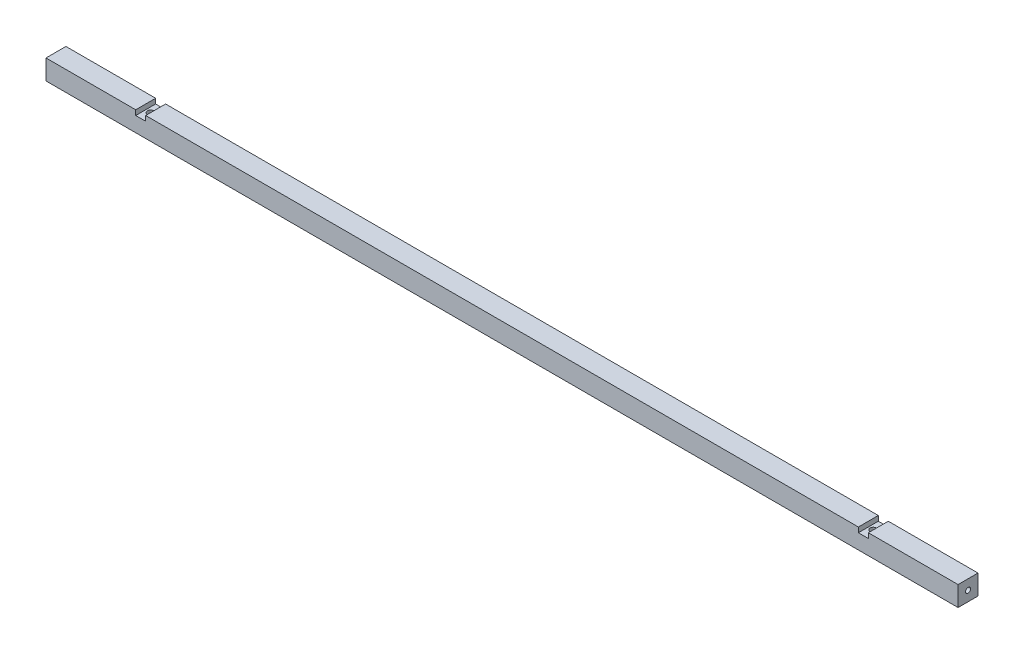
ISO-10303-21;
HEADER;
FILE_DESCRIPTION(('STEP AP214'),'2;1');
FILE_NAME('part.step','',(''),(''),'','','');
FILE_SCHEMA(('AUTOMOTIVE_DESIGN { 1 0 10303 214 1 1 1 1 }'));
ENDSEC;
DATA;
#1=APPLICATION_CONTEXT('core data for automotive mechanical design processes');
#2=APPLICATION_PROTOCOL_DEFINITION('international standard','automotive_design',2000,#1);
#3=PRODUCT_CONTEXT('',#1,'mechanical');
#4=PRODUCT('Part','Part','',(#3));
#5=PRODUCT_RELATED_PRODUCT_CATEGORY('part','',(#4));
#6=PRODUCT_DEFINITION_FORMATION('','',#4);
#7=PRODUCT_DEFINITION_CONTEXT('part definition',#1,'design');
#8=PRODUCT_DEFINITION('design','',#6,#7);
#9=PRODUCT_DEFINITION_SHAPE('','',#8);
#10=(LENGTH_UNIT() NAMED_UNIT(*) SI_UNIT(.MILLI.,.METRE.));
#11=(NAMED_UNIT(*) PLANE_ANGLE_UNIT() SI_UNIT($,.RADIAN.));
#12=(NAMED_UNIT(*) SI_UNIT($,.STERADIAN.) SOLID_ANGLE_UNIT());
#13=UNCERTAINTY_MEASURE_WITH_UNIT(LENGTH_MEASURE(1.E-05),#10,'distance_accuracy_value','');
#14=(GEOMETRIC_REPRESENTATION_CONTEXT(3) GLOBAL_UNCERTAINTY_ASSIGNED_CONTEXT((#13)) GLOBAL_UNIT_ASSIGNED_CONTEXT((#10,
#11,#12)) REPRESENTATION_CONTEXT('',''));
#15=CARTESIAN_POINT('',(0.,0.,0.));
#16=DIRECTION('',(0.,0.,1.));
#17=DIRECTION('',(1.,0.,0.));
#18=AXIS2_PLACEMENT_3D('',#15,#16,#17);
#19=CARTESIAN_POINT('',(0.,20.,10.));
#20=DIRECTION('',(1.,0.,0.));
#21=DIRECTION('',(0.,1.,0.));
#22=AXIS2_PLACEMENT_3D('',#19,#20,#21);
#23=PLANE('',#22);
#24=CARTESIAN_POINT('',(0.,10.,0.));
#25=DIRECTION('',(-1.,0.,0.));
#26=DIRECTION('',(0.,0.,1.));
#27=AXIS2_PLACEMENT_3D('',#24,#25,#26);
#28=CIRCLE('',#27,2.49999999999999);
#29=CARTESIAN_POINT('',(0.,10.,2.49999999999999));
#30=VERTEX_POINT('',#29);
#31=EDGE_CURVE('E300',#30,#30,#28,.T.);
#32=ORIENTED_EDGE('',*,*,#31,.F.);
#33=EDGE_LOOP('',(#32));
#34=FACE_BOUND('',#33,.T.);
#35=DIRECTION('',(0.,-1.,0.));
#36=VECTOR('',#35,1.);
#37=CARTESIAN_POINT('',(0.,20.,-10.));
#38=LINE('',#37,#36);
#39=CARTESIAN_POINT('',(0.,20.,-10.));
#40=VERTEX_POINT('',#39);
#41=CARTESIAN_POINT('',(0.,0.,-10.));
#42=VERTEX_POINT('',#41);
#43=EDGE_CURVE('E167',#40,#42,#38,.T.);
#44=ORIENTED_EDGE('',*,*,#43,.T.);
#45=DIRECTION('',(0.,0.,-1.));
#46=VECTOR('',#45,1.);
#47=CARTESIAN_POINT('',(0.,0.,10.));
#48=LINE('',#47,#46);
#49=CARTESIAN_POINT('',(0.,0.,10.));
#50=VERTEX_POINT('',#49);
#51=EDGE_CURVE('E11',#50,#42,#48,.T.);
#52=ORIENTED_EDGE('',*,*,#51,.F.);
#53=DIRECTION('',(0.,-1.,0.));
#54=VECTOR('',#53,1.);
#55=CARTESIAN_POINT('',(0.,20.,10.));
#56=LINE('',#55,#54);
#57=CARTESIAN_POINT('',(0.,20.,10.));
#58=VERTEX_POINT('',#57);
#59=EDGE_CURVE('E202',#58,#50,#56,.T.);
#60=ORIENTED_EDGE('',*,*,#59,.F.);
#61=DIRECTION('',(0.,0.,-1.));
#62=VECTOR('',#61,1.);
#63=CARTESIAN_POINT('',(0.,20.,10.));
#64=LINE('',#63,#62);
#65=EDGE_CURVE('E163',#58,#40,#64,.T.);
#66=ORIENTED_EDGE('',*,*,#65,.T.);
#67=EDGE_LOOP('',(#44,#52,#60,#66));
#68=FACE_BOUND('',#67,.T.);
#69=ADVANCED_FACE('F38',(#34,#68),#23,.F.);
#70=CARTESIAN_POINT('',(0.,0.,10.));
#71=DIRECTION('',(0.,1.,0.));
#72=DIRECTION('',(0.,0.,1.));
#73=AXIS2_PLACEMENT_3D('',#70,#71,#72);
#74=PLANE('',#73);
#75=CARTESIAN_POINT('',(95.,0.,0.));
#76=DIRECTION('',(0.,1.,0.));
#77=DIRECTION('',(0.,0.,1.));
#78=AXIS2_PLACEMENT_3D('',#75,#76,#77);
#79=CIRCLE('',#78,3.25000000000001);
#80=CARTESIAN_POINT('',(95.,0.,3.25000000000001));
#81=VERTEX_POINT('',#80);
#82=EDGE_CURVE('E276',#81,#81,#79,.F.);
#83=ORIENTED_EDGE('',*,*,#82,.F.);
#84=EDGE_LOOP('',(#83));
#85=FACE_BOUND('',#84,.T.);
#86=CARTESIAN_POINT('',(820.,0.,0.));
#87=DIRECTION('',(0.,1.,0.));
#88=DIRECTION('',(0.,0.,1.));
#89=AXIS2_PLACEMENT_3D('',#86,#87,#88);
#90=CIRCLE('',#89,3.24999999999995);
#91=CARTESIAN_POINT('',(820.,0.,3.24999999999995));
#92=VERTEX_POINT('',#91);
#93=EDGE_CURVE('E172',#92,#92,#90,.F.);
#94=ORIENTED_EDGE('',*,*,#93,.F.);
#95=EDGE_LOOP('',(#94));
#96=FACE_BOUND('',#95,.T.);
#97=DIRECTION('',(1.,0.,0.));
#98=VECTOR('',#97,1.);
#99=CARTESIAN_POINT('',(0.,0.,-10.));
#100=LINE('',#99,#98);
#101=CARTESIAN_POINT('',(915.,0.,-10.));
#102=VERTEX_POINT('',#101);
#103=EDGE_CURVE('E171',#42,#102,#100,.T.);
#104=ORIENTED_EDGE('',*,*,#103,.T.);
#105=DIRECTION('',(0.,0.,-1.));
#106=VECTOR('',#105,1.);
#107=CARTESIAN_POINT('',(915.,0.,10.));
#108=LINE('',#107,#106);
#109=CARTESIAN_POINT('',(915.,0.,10.));
#110=VERTEX_POINT('',#109);
#111=EDGE_CURVE('E47',#110,#102,#108,.T.);
#112=ORIENTED_EDGE('',*,*,#111,.F.);
#113=DIRECTION('',(1.,0.,0.));
#114=VECTOR('',#113,1.);
#115=CARTESIAN_POINT('',(0.,0.,10.));
#116=LINE('',#115,#114);
#117=EDGE_CURVE('E111',#50,#110,#116,.T.);
#118=ORIENTED_EDGE('',*,*,#117,.F.);
#119=ORIENTED_EDGE('',*,*,#51,.T.);
#120=EDGE_LOOP('',(#104,#112,#118,#119));
#121=FACE_BOUND('',#120,.T.);
#122=ADVANCED_FACE('F320',(#85,#96,#121),#74,.F.);
#123=CARTESIAN_POINT('',(915.,0.,10.));
#124=DIRECTION('',(-1.,0.,0.));
#125=DIRECTION('',(0.,0.,1.));
#126=AXIS2_PLACEMENT_3D('',#123,#124,#125);
#127=PLANE('',#126);
#128=CARTESIAN_POINT('',(915.,10.,0.));
#129=DIRECTION('',(1.,0.,0.));
#130=DIRECTION('',(0.,0.,-1.));
#131=AXIS2_PLACEMENT_3D('',#128,#129,#130);
#132=CIRCLE('',#131,2.49999999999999);
#133=CARTESIAN_POINT('',(915.,10.,-2.49999999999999));
#134=VERTEX_POINT('',#133);
#135=EDGE_CURVE('E293',#134,#134,#132,.T.);
#136=ORIENTED_EDGE('',*,*,#135,.F.);
#137=EDGE_LOOP('',(#136));
#138=FACE_BOUND('',#137,.T.);
#139=DIRECTION('',(0.,1.,0.));
#140=VECTOR('',#139,1.);
#141=CARTESIAN_POINT('',(915.,0.,-10.));
#142=LINE('',#141,#140);
#143=CARTESIAN_POINT('',(915.,20.,-10.));
#144=VERTEX_POINT('',#143);
#145=EDGE_CURVE('E175',#102,#144,#142,.T.);
#146=ORIENTED_EDGE('',*,*,#145,.T.);
#147=DIRECTION('',(0.,0.,-1.));
#148=VECTOR('',#147,1.);
#149=CARTESIAN_POINT('',(915.,20.,10.));
#150=LINE('',#149,#148);
#151=CARTESIAN_POINT('',(915.,20.,10.));
#152=VERTEX_POINT('',#151);
#153=EDGE_CURVE('E229',#152,#144,#150,.T.);
#154=ORIENTED_EDGE('',*,*,#153,.F.);
#155=DIRECTION('',(0.,1.,0.));
#156=VECTOR('',#155,1.);
#157=CARTESIAN_POINT('',(915.,0.,10.));
#158=LINE('',#157,#156);
#159=EDGE_CURVE('E240',#110,#152,#158,.T.);
#160=ORIENTED_EDGE('',*,*,#159,.F.);
#161=ORIENTED_EDGE('',*,*,#111,.T.);
#162=EDGE_LOOP('',(#146,#154,#160,#161));
#163=FACE_BOUND('',#162,.T.);
#164=ADVANCED_FACE('F238',(#138,#163),#127,.F.);
#165=CARTESIAN_POINT('',(915.,20.,10.));
#166=DIRECTION('',(0.,-1.,0.));
#167=DIRECTION('',(1.,0.,0.));
#168=AXIS2_PLACEMENT_3D('',#165,#166,#167);
#169=PLANE('',#168);
#170=DIRECTION('',(-1.,0.,0.));
#171=VECTOR('',#170,1.);
#172=CARTESIAN_POINT('',(915.,20.,-10.));
#173=LINE('',#172,#171);
#174=CARTESIAN_POINT('',(825.,20.,-10.));
#175=VERTEX_POINT('',#174);
#176=EDGE_CURVE('E178',#144,#175,#173,.T.);
#177=ORIENTED_EDGE('',*,*,#176,.T.);
#178=DIRECTION('',(0.,0.,-1.));
#179=VECTOR('',#178,1.);
#180=CARTESIAN_POINT('',(825.,20.,10.));
#181=LINE('',#180,#179);
#182=CARTESIAN_POINT('',(825.,20.,10.));
#183=VERTEX_POINT('',#182);
#184=EDGE_CURVE('E225',#183,#175,#181,.T.);
#185=ORIENTED_EDGE('',*,*,#184,.F.);
#186=DIRECTION('',(-1.,0.,0.));
#187=VECTOR('',#186,1.);
#188=CARTESIAN_POINT('',(915.,20.,10.));
#189=LINE('',#188,#187);
#190=EDGE_CURVE('E259',#152,#183,#189,.T.);
#191=ORIENTED_EDGE('',*,*,#190,.F.);
#192=ORIENTED_EDGE('',*,*,#153,.T.);
#193=EDGE_LOOP('',(#177,#185,#191,#192));
#194=FACE_BOUND('',#193,.T.);
#195=ADVANCED_FACE('F249',(#194),#169,.F.);
#196=CARTESIAN_POINT('',(825.,20.,10.));
#197=DIRECTION('',(1.,0.,0.));
#198=DIRECTION('',(0.,0.,-1.));
#199=AXIS2_PLACEMENT_3D('',#196,#197,#198);
#200=PLANE('',#199);
#201=DIRECTION('',(0.,-1.,0.));
#202=VECTOR('',#201,1.);
#203=CARTESIAN_POINT('',(825.,20.,-10.));
#204=LINE('',#203,#202);
#205=CARTESIAN_POINT('',(825.,15.,-10.));
#206=VERTEX_POINT('',#205);
#207=EDGE_CURVE('E181',#175,#206,#204,.T.);
#208=ORIENTED_EDGE('',*,*,#207,.T.);
#209=DIRECTION('',(0.,0.,-1.));
#210=VECTOR('',#209,1.);
#211=CARTESIAN_POINT('',(825.,15.,10.));
#212=LINE('',#211,#210);
#213=CARTESIAN_POINT('',(825.,15.,10.));
#214=VERTEX_POINT('',#213);
#215=EDGE_CURVE('E221',#214,#206,#212,.T.);
#216=ORIENTED_EDGE('',*,*,#215,.F.);
#217=DIRECTION('',(0.,-1.,0.));
#218=VECTOR('',#217,1.);
#219=CARTESIAN_POINT('',(825.,20.,10.));
#220=LINE('',#219,#218);
#221=EDGE_CURVE('E255',#183,#214,#220,.T.);
#222=ORIENTED_EDGE('',*,*,#221,.F.);
#223=ORIENTED_EDGE('',*,*,#184,.T.);
#224=EDGE_LOOP('',(#208,#216,#222,#223));
#225=FACE_BOUND('',#224,.T.);
#226=ADVANCED_FACE('F253',(#225),#200,.F.);
#227=CARTESIAN_POINT('',(825.,15.,10.));
#228=DIRECTION('',(0.,-1.,0.));
#229=DIRECTION('',(1.,0.,0.));
#230=AXIS2_PLACEMENT_3D('',#227,#228,#229);
#231=PLANE('',#230);
#232=CARTESIAN_POINT('',(820.,14.9999999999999,0.));
#233=DIRECTION('',(0.,1.,0.));
#234=DIRECTION('',(0.,0.,1.));
#235=AXIS2_PLACEMENT_3D('',#232,#233,#234);
#236=CIRCLE('',#235,3.24999999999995);
#237=CARTESIAN_POINT('',(820.,14.9999999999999,3.24999999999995));
#238=VERTEX_POINT('',#237);
#239=EDGE_CURVE('E273',#238,#238,#236,.T.);
#240=ORIENTED_EDGE('',*,*,#239,.F.);
#241=EDGE_LOOP('',(#240));
#242=FACE_BOUND('',#241,.T.);
#243=DIRECTION('',(-1.,0.,0.));
#244=VECTOR('',#243,1.);
#245=CARTESIAN_POINT('',(825.,15.,-10.));
#246=LINE('',#245,#244);
#247=CARTESIAN_POINT('',(815.,15.,-10.));
#248=VERTEX_POINT('',#247);
#249=EDGE_CURVE('E184',#206,#248,#246,.T.);
#250=ORIENTED_EDGE('',*,*,#249,.T.);
#251=DIRECTION('',(0.,0.,-1.));
#252=VECTOR('',#251,1.);
#253=CARTESIAN_POINT('',(815.,15.,10.));
#254=LINE('',#253,#252);
#255=CARTESIAN_POINT('',(815.,15.,10.));
#256=VERTEX_POINT('',#255);
#257=EDGE_CURVE('E217',#256,#248,#254,.T.);
#258=ORIENTED_EDGE('',*,*,#257,.F.);
#259=DIRECTION('',(-1.,0.,0.));
#260=VECTOR('',#259,1.);
#261=CARTESIAN_POINT('',(825.,15.,10.));
#262=LINE('',#261,#260);
#263=EDGE_CURVE('E258',#214,#256,#262,.T.);
#264=ORIENTED_EDGE('',*,*,#263,.F.);
#265=ORIENTED_EDGE('',*,*,#215,.T.);
#266=EDGE_LOOP('',(#250,#258,#264,#265));
#267=FACE_BOUND('',#266,.T.);
#268=ADVANCED_FACE('F338',(#242,#267),#231,.F.);
#269=CARTESIAN_POINT('',(815.,15.,10.));
#270=DIRECTION('',(-1.,0.,0.));
#271=DIRECTION('',(0.,0.,1.));
#272=AXIS2_PLACEMENT_3D('',#269,#270,#271);
#273=PLANE('',#272);
#274=DIRECTION('',(0.,1.,0.));
#275=VECTOR('',#274,1.);
#276=CARTESIAN_POINT('',(815.,15.,-10.));
#277=LINE('',#276,#275);
#278=CARTESIAN_POINT('',(815.,20.,-10.));
#279=VERTEX_POINT('',#278);
#280=EDGE_CURVE('E187',#248,#279,#277,.T.);
#281=ORIENTED_EDGE('',*,*,#280,.T.);
#282=DIRECTION('',(0.,0.,-1.));
#283=VECTOR('',#282,1.);
#284=CARTESIAN_POINT('',(815.,20.,10.));
#285=LINE('',#284,#283);
#286=CARTESIAN_POINT('',(815.,20.,10.));
#287=VERTEX_POINT('',#286);
#288=EDGE_CURVE('E213',#287,#279,#285,.T.);
#289=ORIENTED_EDGE('',*,*,#288,.F.);
#290=DIRECTION('',(0.,1.,0.));
#291=VECTOR('',#290,1.);
#292=CARTESIAN_POINT('',(815.,15.,10.));
#293=LINE('',#292,#291);
#294=EDGE_CURVE('E262',#256,#287,#293,.T.);
#295=ORIENTED_EDGE('',*,*,#294,.F.);
#296=ORIENTED_EDGE('',*,*,#257,.T.);
#297=EDGE_LOOP('',(#281,#289,#295,#296));
#298=FACE_BOUND('',#297,.T.);
#299=ADVANCED_FACE('F335',(#298),#273,.F.);
#300=CARTESIAN_POINT('',(815.,20.,10.));
#301=DIRECTION('',(0.,-1.,0.));
#302=DIRECTION('',(1.,0.,0.));
#303=AXIS2_PLACEMENT_3D('',#300,#301,#302);
#304=PLANE('',#303);
#305=DIRECTION('',(-1.,0.,0.));
#306=VECTOR('',#305,1.);
#307=CARTESIAN_POINT('',(815.,20.,-10.));
#308=LINE('',#307,#306);
#309=CARTESIAN_POINT('',(99.9999999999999,19.9999999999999,-10.));
#310=VERTEX_POINT('',#309);
#311=EDGE_CURVE('E190',#279,#310,#308,.T.);
#312=ORIENTED_EDGE('',*,*,#311,.T.);
#313=DIRECTION('',(0.,0.,-1.));
#314=VECTOR('',#313,1.);
#315=CARTESIAN_POINT('',(99.9999999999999,19.9999999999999,10.));
#316=LINE('',#315,#314);
#317=CARTESIAN_POINT('',(99.9999999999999,19.9999999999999,10.));
#318=VERTEX_POINT('',#317);
#319=EDGE_CURVE('E209',#318,#310,#316,.T.);
#320=ORIENTED_EDGE('',*,*,#319,.F.);
#321=DIRECTION('',(-1.,0.,0.));
#322=VECTOR('',#321,1.);
#323=CARTESIAN_POINT('',(815.,20.,10.));
#324=LINE('',#323,#322);
#325=EDGE_CURVE('E270',#287,#318,#324,.T.);
#326=ORIENTED_EDGE('',*,*,#325,.F.);
#327=ORIENTED_EDGE('',*,*,#288,.T.);
#328=EDGE_LOOP('',(#312,#320,#326,#327));
#329=FACE_BOUND('',#328,.T.);
#330=ADVANCED_FACE('F331',(#329),#304,.F.);
#331=CARTESIAN_POINT('',(99.9999999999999,19.9999999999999,10.));
#332=DIRECTION('',(1.,0.,0.));
#333=DIRECTION('',(0.,0.,-1.));
#334=AXIS2_PLACEMENT_3D('',#331,#332,#333);
#335=PLANE('',#334);
#336=DIRECTION('',(0.,-1.,0.));
#337=VECTOR('',#336,1.);
#338=CARTESIAN_POINT('',(99.9999999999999,19.9999999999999,-10.));
#339=LINE('',#338,#337);
#340=CARTESIAN_POINT('',(99.9999999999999,14.9999999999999,-10.));
#341=VERTEX_POINT('',#340);
#342=EDGE_CURVE('E193',#310,#341,#339,.T.);
#343=ORIENTED_EDGE('',*,*,#342,.T.);
#344=DIRECTION('',(0.,0.,-1.));
#345=VECTOR('',#344,1.);
#346=CARTESIAN_POINT('',(99.9999999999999,14.9999999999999,10.));
#347=LINE('',#346,#345);
#348=CARTESIAN_POINT('',(99.9999999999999,14.9999999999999,10.));
#349=VERTEX_POINT('',#348);
#350=EDGE_CURVE('E155',#349,#341,#347,.T.);
#351=ORIENTED_EDGE('',*,*,#350,.F.);
#352=DIRECTION('',(0.,-1.,0.));
#353=VECTOR('',#352,1.);
#354=CARTESIAN_POINT('',(99.9999999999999,19.9999999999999,10.));
#355=LINE('',#354,#353);
#356=EDGE_CURVE('E144',#318,#349,#355,.T.);
#357=ORIENTED_EDGE('',*,*,#356,.F.);
#358=ORIENTED_EDGE('',*,*,#319,.T.);
#359=EDGE_LOOP('',(#343,#351,#357,#358));
#360=FACE_BOUND('',#359,.T.);
#361=ADVANCED_FACE('F327',(#360),#335,.F.);
#362=CARTESIAN_POINT('',(99.9999999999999,14.9999999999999,10.));
#363=DIRECTION('',(0.,-1.,0.));
#364=DIRECTION('',(1.,0.,0.));
#365=AXIS2_PLACEMENT_3D('',#362,#363,#364);
#366=PLANE('',#365);
#367=CARTESIAN_POINT('',(95.,14.9999999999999,0.));
#368=DIRECTION('',(0.,1.,0.));
#369=DIRECTION('',(0.,0.,-1.));
#370=AXIS2_PLACEMENT_3D('',#367,#368,#369);
#371=CIRCLE('',#370,3.25000000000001);
#372=CARTESIAN_POINT('',(95.,14.9999999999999,3.25000000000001));
#373=VERTEX_POINT('',#372);
#374=EDGE_CURVE('E289',#373,#373,#371,.T.);
#375=ORIENTED_EDGE('',*,*,#374,.F.);
#376=EDGE_LOOP('',(#375));
#377=FACE_BOUND('',#376,.T.);
#378=DIRECTION('',(-1.,0.,0.));
#379=VECTOR('',#378,1.);
#380=CARTESIAN_POINT('',(99.9999999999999,14.9999999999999,-10.));
#381=LINE('',#380,#379);
#382=CARTESIAN_POINT('',(89.9999999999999,14.9999999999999,-10.));
#383=VERTEX_POINT('',#382);
#384=EDGE_CURVE('E153',#341,#383,#381,.T.);
#385=ORIENTED_EDGE('',*,*,#384,.T.);
#386=DIRECTION('',(0.,0.,-1.));
#387=VECTOR('',#386,1.);
#388=CARTESIAN_POINT('',(89.9999999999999,14.9999999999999,10.));
#389=LINE('',#388,#387);
#390=CARTESIAN_POINT('',(89.9999999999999,14.9999999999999,10.));
#391=VERTEX_POINT('',#390);
#392=EDGE_CURVE('E150',#391,#383,#389,.T.);
#393=ORIENTED_EDGE('',*,*,#392,.F.);
#394=DIRECTION('',(-1.,0.,0.));
#395=VECTOR('',#394,1.);
#396=CARTESIAN_POINT('',(99.9999999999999,14.9999999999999,10.));
#397=LINE('',#396,#395);
#398=EDGE_CURVE('E138',#349,#391,#397,.T.);
#399=ORIENTED_EDGE('',*,*,#398,.F.);
#400=ORIENTED_EDGE('',*,*,#350,.T.);
#401=EDGE_LOOP('',(#385,#393,#399,#400));
#402=FACE_BOUND('',#401,.T.);
#403=ADVANCED_FACE('F151',(#377,#402),#366,.F.);
#404=CARTESIAN_POINT('',(89.9999999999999,14.9999999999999,10.));
#405=DIRECTION('',(-1.,0.,0.));
#406=DIRECTION('',(0.,-1.,0.));
#407=AXIS2_PLACEMENT_3D('',#404,#405,#406);
#408=PLANE('',#407);
#409=DIRECTION('',(0.,1.,0.));
#410=VECTOR('',#409,1.);
#411=CARTESIAN_POINT('',(89.9999999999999,14.9999999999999,-10.));
#412=LINE('',#411,#410);
#413=CARTESIAN_POINT('',(90.,20.,-10.));
#414=VERTEX_POINT('',#413);
#415=EDGE_CURVE('E97',#383,#414,#412,.T.);
#416=ORIENTED_EDGE('',*,*,#415,.T.);
#417=DIRECTION('',(0.,0.,-1.));
#418=VECTOR('',#417,1.);
#419=CARTESIAN_POINT('',(90.,20.,10.));
#420=LINE('',#419,#418);
#421=CARTESIAN_POINT('',(90.,20.,10.));
#422=VERTEX_POINT('',#421);
#423=EDGE_CURVE('E156',#422,#414,#420,.T.);
#424=ORIENTED_EDGE('',*,*,#423,.F.);
#425=DIRECTION('',(0.,1.,0.));
#426=VECTOR('',#425,1.);
#427=CARTESIAN_POINT('',(89.9999999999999,14.9999999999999,10.));
#428=LINE('',#427,#426);
#429=EDGE_CURVE('E142',#391,#422,#428,.T.);
#430=ORIENTED_EDGE('',*,*,#429,.F.);
#431=ORIENTED_EDGE('',*,*,#392,.T.);
#432=EDGE_LOOP('',(#416,#424,#430,#431));
#433=FACE_BOUND('',#432,.T.);
#434=ADVANCED_FACE('F158',(#433),#408,.F.);
#435=CARTESIAN_POINT('',(90.,20.,10.));
#436=DIRECTION('',(0.,-1.,0.));
#437=DIRECTION('',(1.,0.,0.));
#438=AXIS2_PLACEMENT_3D('',#435,#436,#437);
#439=PLANE('',#438);
#440=DIRECTION('',(-1.,0.,0.));
#441=VECTOR('',#440,1.);
#442=CARTESIAN_POINT('',(90.,20.,-10.));
#443=LINE('',#442,#441);
#444=EDGE_CURVE('E103',#414,#40,#443,.T.);
#445=ORIENTED_EDGE('',*,*,#444,.T.);
#446=ORIENTED_EDGE('',*,*,#65,.F.);
#447=DIRECTION('',(-1.,0.,0.));
#448=VECTOR('',#447,1.);
#449=CARTESIAN_POINT('',(90.,20.,10.));
#450=LINE('',#449,#448);
#451=EDGE_CURVE('E55',#422,#58,#450,.T.);
#452=ORIENTED_EDGE('',*,*,#451,.F.);
#453=ORIENTED_EDGE('',*,*,#423,.T.);
#454=EDGE_LOOP('',(#445,#446,#452,#453));
#455=FACE_BOUND('',#454,.T.);
#456=ADVANCED_FACE('F379',(#455),#439,.F.);
#457=CARTESIAN_POINT('',(0.,0.,10.));
#458=DIRECTION('',(0.,0.,1.));
#459=DIRECTION('',(1.,0.,0.));
#460=AXIS2_PLACEMENT_3D('',#457,#458,#459);
#461=PLANE('',#460);
#462=ORIENTED_EDGE('',*,*,#59,.T.);
#463=ORIENTED_EDGE('',*,*,#117,.T.);
#464=ORIENTED_EDGE('',*,*,#159,.T.);
#465=ORIENTED_EDGE('',*,*,#190,.T.);
#466=ORIENTED_EDGE('',*,*,#221,.T.);
#467=ORIENTED_EDGE('',*,*,#263,.T.);
#468=ORIENTED_EDGE('',*,*,#294,.T.);
#469=ORIENTED_EDGE('',*,*,#325,.T.);
#470=ORIENTED_EDGE('',*,*,#356,.T.);
#471=ORIENTED_EDGE('',*,*,#398,.T.);
#472=ORIENTED_EDGE('',*,*,#429,.T.);
#473=ORIENTED_EDGE('',*,*,#451,.T.);
#474=EDGE_LOOP('',(#462,#463,#464,#465,#466,#467,#468,#469,#470,#471,#472,#473));
#475=FACE_BOUND('',#474,.T.);
#476=ADVANCED_FACE('F140',(#475),#461,.T.);
#477=CARTESIAN_POINT('',(0.,0.,-10.));
#478=DIRECTION('',(0.,0.,1.));
#479=DIRECTION('',(1.,0.,0.));
#480=AXIS2_PLACEMENT_3D('',#477,#478,#479);
#481=PLANE('',#480);
#482=ORIENTED_EDGE('',*,*,#43,.F.);
#483=ORIENTED_EDGE('',*,*,#444,.F.);
#484=ORIENTED_EDGE('',*,*,#415,.F.);
#485=ORIENTED_EDGE('',*,*,#384,.F.);
#486=ORIENTED_EDGE('',*,*,#342,.F.);
#487=ORIENTED_EDGE('',*,*,#311,.F.);
#488=ORIENTED_EDGE('',*,*,#280,.F.);
#489=ORIENTED_EDGE('',*,*,#249,.F.);
#490=ORIENTED_EDGE('',*,*,#207,.F.);
#491=ORIENTED_EDGE('',*,*,#176,.F.);
#492=ORIENTED_EDGE('',*,*,#145,.F.);
#493=ORIENTED_EDGE('',*,*,#103,.F.);
#494=EDGE_LOOP('',(#482,#483,#484,#485,#486,#487,#488,#489,#490,#491,#492,#493));
#495=FACE_BOUND('',#494,.T.);
#496=ADVANCED_FACE('F244',(#495),#481,.F.);
#497=CARTESIAN_POINT('',(820.,-0.000999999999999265,0.));
#498=DIRECTION('',(0.,1.,0.));
#499=DIRECTION('',(0.,0.,1.));
#500=AXIS2_PLACEMENT_3D('',#497,#498,#499);
#501=CYLINDRICAL_SURFACE('',#500,3.24999999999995);
#502=CARTESIAN_POINT('',(820.,14.9999999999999,3.24999999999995));
#503=CARTESIAN_POINT('',(820.,14.8437499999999,3.24999999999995));
#504=CARTESIAN_POINT('',(820.,14.6874999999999,3.24999999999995));
#505=CARTESIAN_POINT('',(820.,14.3749999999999,3.24999999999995));
#506=CARTESIAN_POINT('',(820.,14.2187499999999,3.24999999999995));
#507=CARTESIAN_POINT('',(820.,13.9062499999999,3.24999999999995));
#508=CARTESIAN_POINT('',(820.,13.7499999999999,3.24999999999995));
#509=CARTESIAN_POINT('',(820.,13.4374999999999,3.24999999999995));
#510=CARTESIAN_POINT('',(820.,13.2812499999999,3.24999999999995));
#511=CARTESIAN_POINT('',(820.,12.9687499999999,3.24999999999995));
#512=CARTESIAN_POINT('',(820.,12.8124999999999,3.24999999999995));
#513=CARTESIAN_POINT('',(820.,12.4999999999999,3.24999999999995));
#514=CARTESIAN_POINT('',(820.,12.3437499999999,3.24999999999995));
#515=CARTESIAN_POINT('',(820.,12.0312499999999,3.24999999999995));
#516=CARTESIAN_POINT('',(820.,11.8749999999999,3.24999999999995));
#517=CARTESIAN_POINT('',(820.,11.5624999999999,3.24999999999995));
#518=CARTESIAN_POINT('',(820.,11.4062499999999,3.24999999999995));
#519=CARTESIAN_POINT('',(820.,11.0937499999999,3.24999999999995));
#520=CARTESIAN_POINT('',(820.,10.9374999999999,3.24999999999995));
#521=CARTESIAN_POINT('',(820.,10.6249999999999,3.24999999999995));
#522=CARTESIAN_POINT('',(820.,10.4687499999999,3.24999999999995));
#523=CARTESIAN_POINT('',(820.,10.1562499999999,3.24999999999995));
#524=CARTESIAN_POINT('',(820.,9.99999999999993,3.24999999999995));
#525=CARTESIAN_POINT('',(820.,9.68749999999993,3.24999999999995));
#526=CARTESIAN_POINT('',(820.,9.53124999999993,3.24999999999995));
#527=CARTESIAN_POINT('',(820.,9.21874999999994,3.24999999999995));
#528=CARTESIAN_POINT('',(820.,9.06249999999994,3.24999999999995));
#529=CARTESIAN_POINT('',(820.,8.74999999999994,3.24999999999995));
#530=CARTESIAN_POINT('',(820.,8.59374999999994,3.24999999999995));
#531=CARTESIAN_POINT('',(820.,8.28124999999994,3.24999999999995));
#532=CARTESIAN_POINT('',(820.,8.12499999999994,3.24999999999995));
#533=CARTESIAN_POINT('',(820.,7.81249999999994,3.24999999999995));
#534=CARTESIAN_POINT('',(820.,7.65624999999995,3.24999999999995));
#535=CARTESIAN_POINT('',(820.,7.34374999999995,3.24999999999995));
#536=CARTESIAN_POINT('',(820.,7.18749999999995,3.24999999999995));
#537=CARTESIAN_POINT('',(820.,6.87499999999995,3.24999999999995));
#538=CARTESIAN_POINT('',(820.,6.71874999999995,3.24999999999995));
#539=CARTESIAN_POINT('',(820.,6.40624999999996,3.24999999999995));
#540=CARTESIAN_POINT('',(820.,6.24999999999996,3.24999999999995));
#541=CARTESIAN_POINT('',(820.,5.93749999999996,3.24999999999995));
#542=CARTESIAN_POINT('',(820.,5.78124999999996,3.24999999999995));
#543=CARTESIAN_POINT('',(820.,5.46874999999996,3.24999999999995));
#544=CARTESIAN_POINT('',(820.,5.31249999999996,3.24999999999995));
#545=CARTESIAN_POINT('',(820.,4.99999999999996,3.24999999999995));
#546=CARTESIAN_POINT('',(820.,4.84374999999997,3.24999999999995));
#547=CARTESIAN_POINT('',(820.,4.53124999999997,3.24999999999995));
#548=CARTESIAN_POINT('',(820.,4.37499999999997,3.24999999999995));
#549=CARTESIAN_POINT('',(820.,4.06249999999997,3.24999999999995));
#550=CARTESIAN_POINT('',(820.,3.90624999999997,3.24999999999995));
#551=CARTESIAN_POINT('',(820.,3.59374999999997,3.24999999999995));
#552=CARTESIAN_POINT('',(820.,3.43749999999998,3.24999999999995));
#553=CARTESIAN_POINT('',(820.,3.12499999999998,3.24999999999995));
#554=CARTESIAN_POINT('',(820.,2.96874999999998,3.24999999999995));
#555=CARTESIAN_POINT('',(820.,2.65624999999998,3.24999999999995));
#556=CARTESIAN_POINT('',(820.,2.49999999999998,3.24999999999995));
#557=CARTESIAN_POINT('',(820.,2.18749999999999,3.24999999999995));
#558=CARTESIAN_POINT('',(820.,2.03124999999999,3.24999999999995));
#559=CARTESIAN_POINT('',(820.,1.71874999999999,3.24999999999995));
#560=CARTESIAN_POINT('',(820.,1.56249999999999,3.24999999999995));
#561=CARTESIAN_POINT('',(820.,1.24999999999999,3.24999999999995));
#562=CARTESIAN_POINT('',(820.,1.09374999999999,3.24999999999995));
#563=CARTESIAN_POINT('',(820.,0.781249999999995,3.24999999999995));
#564=CARTESIAN_POINT('',(820.,0.624999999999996,3.24999999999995));
#565=CARTESIAN_POINT('',(820.,0.312499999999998,3.24999999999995));
#566=CARTESIAN_POINT('',(820.,0.156249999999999,3.24999999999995));
#567=CARTESIAN_POINT('',(820.,0.,3.24999999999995));
#568=B_SPLINE_CURVE_WITH_KNOTS('',3,(#502,#503,#504,#505,#506,#507,#508,#509,#510,#511,#512,
#513,#514,#515,#516,#517,#518,#519,#520,#521,#522,#523,#524,#525,#526,#527,#528,#529,#530,#531,
#532,#533,#534,#535,#536,#537,#538,#539,#540,#541,#542,#543,#544,#545,#546,#547,#548,#549,#550,
#551,#552,#553,#554,#555,#556,#557,#558,#559,#560,#561,#562,#563,#564,#565,#566,#567),
.UNSPECIFIED.,.F.,.F.,(4,2,2,2,2,2,2,2,2,2,2,2,2,2,2,2,2,2,2,2,2,2,2,2,2,2,2,2,2,2,2,2,4),(0.,
0.468749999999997,0.937499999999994,1.40624999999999,1.87499999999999,2.34374999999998,
2.81249999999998,3.28124999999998,3.74999999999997,4.21874999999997,4.68749999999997,
5.15624999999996,5.62499999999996,6.09374999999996,6.56249999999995,7.03124999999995,
7.49999999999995,7.96874999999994,8.43749999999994,8.90624999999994,9.37499999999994,
9.84374999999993,10.3124999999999,10.7812499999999,11.2499999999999,11.7187499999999,
12.1874999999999,12.6562499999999,13.1249999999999,13.5937499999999,14.0624999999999,
14.5312499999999,14.9999999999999),.UNSPECIFIED.);
#569=EDGE_CURVE('BSEAM363',#238,#92,#568,.T.);
#570=ORIENTED_EDGE('',*,*,#239,.T.);
#571=ORIENTED_EDGE('',*,*,#93,.T.);
#572=ORIENTED_EDGE('',*,*,#569,.T.);
#573=ORIENTED_EDGE('',*,*,#569,.F.);
#574=EDGE_LOOP('',(#570,#572,#571,#573));
#575=FACE_BOUND('',#574,.T.);
#576=ADVANCED_FACE('F363',(#575),#501,.F.);
#577=CARTESIAN_POINT('',(95.,-0.000999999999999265,0.));
#578=DIRECTION('',(0.,1.,0.));
#579=DIRECTION('',(0.,0.,1.));
#580=AXIS2_PLACEMENT_3D('',#577,#578,#579);
#581=CYLINDRICAL_SURFACE('',#580,3.25000000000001);
#582=CARTESIAN_POINT('',(95.,14.9999999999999,3.25000000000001));
#583=CARTESIAN_POINT('',(95.,14.8437499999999,3.25000000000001));
#584=CARTESIAN_POINT('',(95.,14.6874999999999,3.25000000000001));
#585=CARTESIAN_POINT('',(95.,14.3749999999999,3.25000000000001));
#586=CARTESIAN_POINT('',(95.,14.2187499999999,3.25000000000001));
#587=CARTESIAN_POINT('',(95.,13.9062499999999,3.25000000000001));
#588=CARTESIAN_POINT('',(95.,13.7499999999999,3.25000000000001));
#589=CARTESIAN_POINT('',(95.,13.4374999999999,3.25000000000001));
#590=CARTESIAN_POINT('',(95.,13.2812499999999,3.25000000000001));
#591=CARTESIAN_POINT('',(95.,12.9687499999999,3.25000000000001));
#592=CARTESIAN_POINT('',(95.,12.8124999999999,3.25000000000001));
#593=CARTESIAN_POINT('',(95.,12.4999999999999,3.25000000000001));
#594=CARTESIAN_POINT('',(95.,12.3437499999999,3.25000000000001));
#595=CARTESIAN_POINT('',(95.,12.0312499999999,3.25000000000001));
#596=CARTESIAN_POINT('',(95.,11.8749999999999,3.25000000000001));
#597=CARTESIAN_POINT('',(95.,11.5624999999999,3.25000000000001));
#598=CARTESIAN_POINT('',(95.,11.4062499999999,3.25000000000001));
#599=CARTESIAN_POINT('',(95.,11.0937499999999,3.25000000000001));
#600=CARTESIAN_POINT('',(95.,10.9374999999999,3.25000000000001));
#601=CARTESIAN_POINT('',(95.,10.6249999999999,3.25000000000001));
#602=CARTESIAN_POINT('',(95.,10.4687499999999,3.25000000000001));
#603=CARTESIAN_POINT('',(95.,10.1562499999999,3.25000000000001));
#604=CARTESIAN_POINT('',(95.,9.99999999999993,3.25000000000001));
#605=CARTESIAN_POINT('',(95.,9.68749999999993,3.25000000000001));
#606=CARTESIAN_POINT('',(95.,9.53124999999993,3.25000000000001));
#607=CARTESIAN_POINT('',(95.,9.21874999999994,3.25000000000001));
#608=CARTESIAN_POINT('',(95.,9.06249999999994,3.25000000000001));
#609=CARTESIAN_POINT('',(95.,8.74999999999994,3.25000000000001));
#610=CARTESIAN_POINT('',(95.,8.59374999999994,3.25000000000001));
#611=CARTESIAN_POINT('',(95.,8.28124999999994,3.25000000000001));
#612=CARTESIAN_POINT('',(95.,8.12499999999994,3.25000000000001));
#613=CARTESIAN_POINT('',(95.,7.81249999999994,3.25000000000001));
#614=CARTESIAN_POINT('',(95.,7.65624999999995,3.25000000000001));
#615=CARTESIAN_POINT('',(95.,7.34374999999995,3.25000000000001));
#616=CARTESIAN_POINT('',(95.,7.18749999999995,3.25000000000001));
#617=CARTESIAN_POINT('',(95.,6.87499999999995,3.25000000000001));
#618=CARTESIAN_POINT('',(95.,6.71874999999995,3.25000000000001));
#619=CARTESIAN_POINT('',(95.,6.40624999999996,3.25000000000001));
#620=CARTESIAN_POINT('',(95.,6.24999999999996,3.25000000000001));
#621=CARTESIAN_POINT('',(95.,5.93749999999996,3.25000000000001));
#622=CARTESIAN_POINT('',(95.,5.78124999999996,3.25000000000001));
#623=CARTESIAN_POINT('',(95.,5.46874999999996,3.25000000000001));
#624=CARTESIAN_POINT('',(95.,5.31249999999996,3.25000000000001));
#625=CARTESIAN_POINT('',(95.,4.99999999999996,3.25000000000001));
#626=CARTESIAN_POINT('',(95.,4.84374999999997,3.25000000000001));
#627=CARTESIAN_POINT('',(95.,4.53124999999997,3.25000000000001));
#628=CARTESIAN_POINT('',(95.,4.37499999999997,3.25000000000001));
#629=CARTESIAN_POINT('',(95.,4.06249999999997,3.25000000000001));
#630=CARTESIAN_POINT('',(95.,3.90624999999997,3.25000000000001));
#631=CARTESIAN_POINT('',(95.,3.59374999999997,3.25000000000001));
#632=CARTESIAN_POINT('',(95.,3.43749999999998,3.25000000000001));
#633=CARTESIAN_POINT('',(95.,3.12499999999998,3.25000000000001));
#634=CARTESIAN_POINT('',(95.,2.96874999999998,3.25000000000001));
#635=CARTESIAN_POINT('',(95.,2.65624999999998,3.25000000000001));
#636=CARTESIAN_POINT('',(95.,2.49999999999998,3.25000000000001));
#637=CARTESIAN_POINT('',(95.,2.18749999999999,3.25000000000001));
#638=CARTESIAN_POINT('',(95.,2.03124999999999,3.25000000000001));
#639=CARTESIAN_POINT('',(95.,1.71874999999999,3.25000000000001));
#640=CARTESIAN_POINT('',(95.,1.56249999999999,3.25000000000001));
#641=CARTESIAN_POINT('',(95.,1.24999999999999,3.25000000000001));
#642=CARTESIAN_POINT('',(95.,1.09374999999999,3.25000000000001));
#643=CARTESIAN_POINT('',(95.,0.781249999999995,3.25000000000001));
#644=CARTESIAN_POINT('',(95.,0.624999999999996,3.25000000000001));
#645=CARTESIAN_POINT('',(95.,0.312499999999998,3.25000000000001));
#646=CARTESIAN_POINT('',(95.,0.156249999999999,3.25000000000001));
#647=CARTESIAN_POINT('',(95.,0.,3.25000000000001));
#648=B_SPLINE_CURVE_WITH_KNOTS('',3,(#582,#583,#584,#585,#586,#587,#588,#589,#590,#591,#592,
#593,#594,#595,#596,#597,#598,#599,#600,#601,#602,#603,#604,#605,#606,#607,#608,#609,#610,#611,
#612,#613,#614,#615,#616,#617,#618,#619,#620,#621,#622,#623,#624,#625,#626,#627,#628,#629,#630,
#631,#632,#633,#634,#635,#636,#637,#638,#639,#640,#641,#642,#643,#644,#645,#646,#647),
.UNSPECIFIED.,.F.,.F.,(4,2,2,2,2,2,2,2,2,2,2,2,2,2,2,2,2,2,2,2,2,2,2,2,2,2,2,2,2,2,2,2,4),(0.,
0.468749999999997,0.937499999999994,1.40624999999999,1.87499999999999,2.34374999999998,
2.81249999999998,3.28124999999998,3.74999999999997,4.21874999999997,4.68749999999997,
5.15624999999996,5.62499999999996,6.09374999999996,6.56249999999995,7.03124999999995,
7.49999999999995,7.96874999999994,8.43749999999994,8.90624999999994,9.37499999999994,
9.84374999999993,10.3124999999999,10.7812499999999,11.2499999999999,11.7187499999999,
12.1874999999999,12.6562499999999,13.1249999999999,13.5937499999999,14.0624999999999,
14.5312499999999,14.9999999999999),.UNSPECIFIED.);
#649=EDGE_CURVE('BSEAM365',#373,#81,#648,.T.);
#650=ORIENTED_EDGE('',*,*,#374,.T.);
#651=ORIENTED_EDGE('',*,*,#82,.T.);
#652=ORIENTED_EDGE('',*,*,#649,.T.);
#653=ORIENTED_EDGE('',*,*,#649,.F.);
#654=EDGE_LOOP('',(#650,#652,#651,#653));
#655=FACE_BOUND('',#654,.T.);
#656=ADVANCED_FACE('F365',(#655),#581,.F.);
#657=CARTESIAN_POINT('',(915.,10.,0.));
#658=DIRECTION('',(1.,0.,0.));
#659=DIRECTION('',(0.,0.,-1.));
#660=AXIS2_PLACEMENT_3D('',#657,#658,#659);
#661=CYLINDRICAL_SURFACE('',#660,2.49999999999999);
#662=CARTESIAN_POINT('',(897.,10.,0.));
#663=DIRECTION('',(1.,0.,0.));
#664=DIRECTION('',(0.,0.,-1.));
#665=AXIS2_PLACEMENT_3D('',#662,#663,#664);
#666=CIRCLE('',#665,2.5);
#667=CARTESIAN_POINT('',(897.,10.,-2.5));
#668=VERTEX_POINT('',#667);
#669=EDGE_CURVE('E296',#668,#668,#666,.T.);
#670=ORIENTED_EDGE('',*,*,#669,.F.);
#671=EDGE_LOOP('',(#670));
#672=FACE_BOUND('',#671,.T.);
#673=ORIENTED_EDGE('',*,*,#135,.T.);
#674=EDGE_LOOP('',(#673));
#675=FACE_BOUND('',#674,.T.);
#676=ADVANCED_FACE('F372',(#672,#675),#661,.F.);
#677=CARTESIAN_POINT('',(897.,10.,0.));
#678=DIRECTION('',(1.,0.,0.));
#679=DIRECTION('',(0.,0.,-1.));
#680=AXIS2_PLACEMENT_3D('',#677,#678,#679);
#681=CONICAL_SURFACE('',#680,2.5,1.02974425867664);
#682=CARTESIAN_POINT('',(895.497848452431,9.99999999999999,0.));
#683=VERTEX_POINT('',#682);
#684=VERTEX_LOOP('',#683);
#685=FACE_BOUND('',#684,.T.);
#686=ORIENTED_EDGE('',*,*,#669,.T.);
#687=EDGE_LOOP('',(#686));
#688=FACE_BOUND('',#687,.T.);
#689=ADVANCED_FACE('F314',(#685,#688),#681,.F.);
#690=CARTESIAN_POINT('',(0.,10.,0.));
#691=DIRECTION('',(-1.,0.,0.));
#692=DIRECTION('',(0.,0.,1.));
#693=AXIS2_PLACEMENT_3D('',#690,#691,#692);
#694=CYLINDRICAL_SURFACE('',#693,2.49999999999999);
#695=CARTESIAN_POINT('',(18.,10.,0.));
#696=DIRECTION('',(-1.,0.,0.));
#697=DIRECTION('',(0.,0.,1.));
#698=AXIS2_PLACEMENT_3D('',#695,#696,#697);
#699=CIRCLE('',#698,2.5);
#700=CARTESIAN_POINT('',(18.,10.,2.5));
#701=VERTEX_POINT('',#700);
#702=EDGE_CURVE('E304',#701,#701,#699,.T.);
#703=ORIENTED_EDGE('',*,*,#702,.F.);
#704=EDGE_LOOP('',(#703));
#705=FACE_BOUND('',#704,.T.);
#706=ORIENTED_EDGE('',*,*,#31,.T.);
#707=EDGE_LOOP('',(#706));
#708=FACE_BOUND('',#707,.T.);
#709=ADVANCED_FACE('F311',(#705,#708),#694,.F.);
#710=CARTESIAN_POINT('',(18.,10.,0.));
#711=DIRECTION('',(-1.,0.,0.));
#712=DIRECTION('',(0.,0.,1.));
#713=AXIS2_PLACEMENT_3D('',#710,#711,#712);
#714=CONICAL_SURFACE('',#713,2.5,1.02974425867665);
#715=CARTESIAN_POINT('',(19.5021515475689,9.99999999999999,0.));
#716=VERTEX_POINT('',#715);
#717=VERTEX_LOOP('',#716);
#718=FACE_BOUND('',#717,.T.);
#719=ORIENTED_EDGE('',*,*,#702,.T.);
#720=EDGE_LOOP('',(#719));
#721=FACE_BOUND('',#720,.T.);
#722=ADVANCED_FACE('F309',(#718,#721),#714,.F.);
#723=CLOSED_SHELL('',(#69,#122,#164,#195,#226,#268,#299,#330,#361,#403,#434,#456,#476,#496,#576,
#656,#676,#689,#709,#722));
#724=MANIFOLD_SOLID_BREP('B2',#723);
#725=ADVANCED_BREP_SHAPE_REPRESENTATION('',(#18,#724),#14);
#726=SHAPE_DEFINITION_REPRESENTATION(#9,#725);
ENDSEC;
END-ISO-10303-21;
